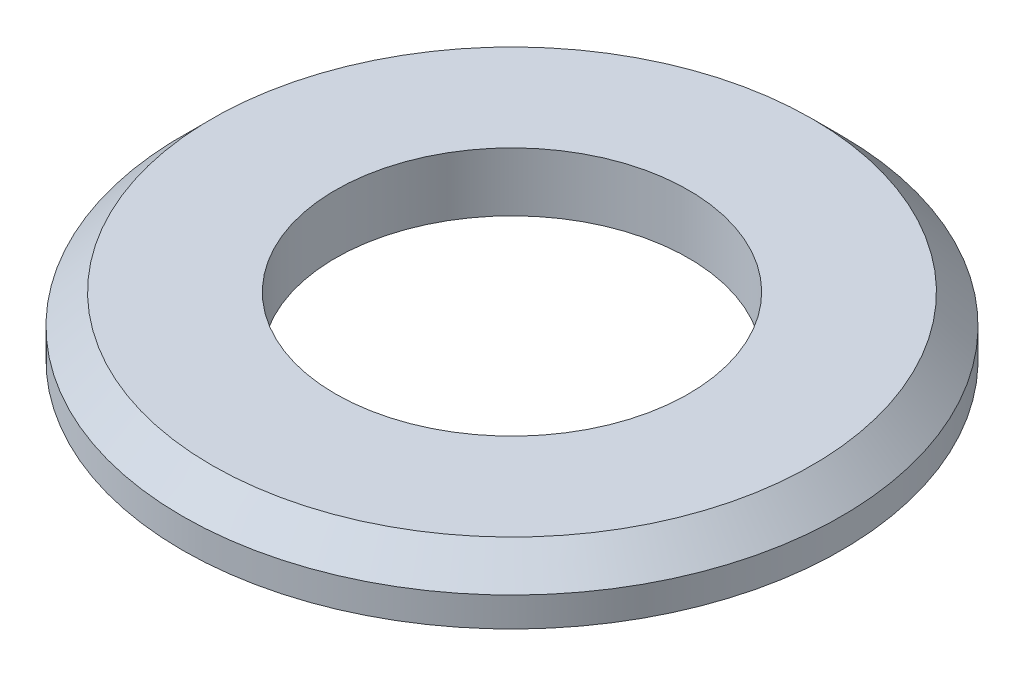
ISO-10303-21;
HEADER;
FILE_DESCRIPTION(('STEP AP214'),'2;1');
FILE_NAME('part.step','',(''),(''),'','','');
FILE_SCHEMA(('AUTOMOTIVE_DESIGN { 1 0 10303 214 1 1 1 1 }'));
ENDSEC;
DATA;
#1=APPLICATION_CONTEXT('core data for automotive mechanical design processes');
#2=APPLICATION_PROTOCOL_DEFINITION('international standard','automotive_design',2000,#1);
#3=PRODUCT_CONTEXT('',#1,'mechanical');
#4=PRODUCT('Part','Part','',(#3));
#5=PRODUCT_RELATED_PRODUCT_CATEGORY('part','',(#4));
#6=PRODUCT_DEFINITION_FORMATION('','',#4);
#7=PRODUCT_DEFINITION_CONTEXT('part definition',#1,'design');
#8=PRODUCT_DEFINITION('design','',#6,#7);
#9=PRODUCT_DEFINITION_SHAPE('','',#8);
#10=(LENGTH_UNIT() NAMED_UNIT(*) SI_UNIT(.MILLI.,.METRE.));
#11=(NAMED_UNIT(*) PLANE_ANGLE_UNIT() SI_UNIT($,.RADIAN.));
#12=(NAMED_UNIT(*) SI_UNIT($,.STERADIAN.) SOLID_ANGLE_UNIT());
#13=UNCERTAINTY_MEASURE_WITH_UNIT(LENGTH_MEASURE(1.E-05),#10,'distance_accuracy_value','');
#14=(GEOMETRIC_REPRESENTATION_CONTEXT(3) GLOBAL_UNCERTAINTY_ASSIGNED_CONTEXT((#13)) GLOBAL_UNIT_ASSIGNED_CONTEXT((#10,
#11,#12)) REPRESENTATION_CONTEXT('',''));
#15=CARTESIAN_POINT('',(0.,0.,0.));
#16=DIRECTION('',(0.,0.,1.));
#17=DIRECTION('',(1.,0.,0.));
#18=AXIS2_PLACEMENT_3D('',#15,#16,#17);
#19=CARTESIAN_POINT('',(0.,2.5,0.));
#20=DIRECTION('',(0.,1.,0.));
#21=DIRECTION('',(0.,0.,1.));
#22=AXIS2_PLACEMENT_3D('',#19,#20,#21);
#23=PLANE('',#22);
#24=CARTESIAN_POINT('',(0.,2.5,0.));
#25=DIRECTION('',(0.,1.,0.));
#26=DIRECTION('',(0.,0.,1.));
#27=AXIS2_PLACEMENT_3D('',#24,#25,#26);
#28=CIRCLE('',#27,12.75);
#29=CARTESIAN_POINT('',(0.,2.5,-12.75));
#30=VERTEX_POINT('',#29);
#31=EDGE_CURVE('E35',#30,#30,#28,.T.);
#32=ORIENTED_EDGE('',*,*,#31,.T.);
#33=EDGE_LOOP('',(#32));
#34=FACE_BOUND('',#33,.T.);
#35=CARTESIAN_POINT('',(0.,2.5,0.));
#36=DIRECTION('',(0.,1.,0.));
#37=DIRECTION('',(0.,0.,1.));
#38=AXIS2_PLACEMENT_3D('',#35,#36,#37);
#39=CIRCLE('',#38,7.5);
#40=CARTESIAN_POINT('',(0.,2.5,7.5));
#41=VERTEX_POINT('',#40);
#42=EDGE_CURVE('E43',#41,#41,#39,.T.);
#43=ORIENTED_EDGE('',*,*,#42,.F.);
#44=EDGE_LOOP('',(#43));
#45=FACE_BOUND('',#44,.T.);
#46=ADVANCED_FACE('F28',(#34,#45),#23,.T.);
#47=CARTESIAN_POINT('',(0.,0.,0.));
#48=DIRECTION('',(0.,1.,0.));
#49=DIRECTION('',(0.,0.,1.));
#50=AXIS2_PLACEMENT_3D('',#47,#48,#49);
#51=PLANE('',#50);
#52=CARTESIAN_POINT('',(0.,0.,0.));
#53=DIRECTION('',(0.,1.,0.));
#54=DIRECTION('',(0.,0.,1.));
#55=AXIS2_PLACEMENT_3D('',#52,#53,#54);
#56=CIRCLE('',#55,14.);
#57=CARTESIAN_POINT('',(0.,0.,14.));
#58=VERTEX_POINT('',#57);
#59=EDGE_CURVE('E39',#58,#58,#56,.T.);
#60=ORIENTED_EDGE('',*,*,#59,.F.);
#61=EDGE_LOOP('',(#60));
#62=FACE_BOUND('',#61,.T.);
#63=CARTESIAN_POINT('',(0.,0.,0.));
#64=DIRECTION('',(0.,1.,0.));
#65=DIRECTION('',(0.,0.,1.));
#66=AXIS2_PLACEMENT_3D('',#63,#64,#65);
#67=CIRCLE('',#66,7.5);
#68=CARTESIAN_POINT('',(0.,0.,7.5));
#69=VERTEX_POINT('',#68);
#70=EDGE_CURVE('E48',#69,#69,#67,.T.);
#71=ORIENTED_EDGE('',*,*,#70,.T.);
#72=EDGE_LOOP('',(#71));
#73=FACE_BOUND('',#72,.T.);
#74=ADVANCED_FACE('F52',(#62,#73),#51,.F.);
#75=CARTESIAN_POINT('',(0.,2.5,0.));
#76=DIRECTION('',(0.,-1.,0.));
#77=DIRECTION('',(0.,0.,-1.));
#78=AXIS2_PLACEMENT_3D('',#75,#76,#77);
#79=CYLINDRICAL_SURFACE('',#78,14.);
#80=CARTESIAN_POINT('',(0.,1.24999999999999,0.));
#81=DIRECTION('',(0.,1.,0.));
#82=DIRECTION('',(0.,0.,1.));
#83=AXIS2_PLACEMENT_3D('',#80,#81,#82);
#84=CIRCLE('',#83,14.);
#85=CARTESIAN_POINT('',(0.,1.24999999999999,-14.));
#86=VERTEX_POINT('',#85);
#87=EDGE_CURVE('E10',#86,#86,#84,.F.);
#88=ORIENTED_EDGE('',*,*,#87,.T.);
#89=EDGE_LOOP('',(#88));
#90=FACE_BOUND('',#89,.T.);
#91=ORIENTED_EDGE('',*,*,#59,.T.);
#92=EDGE_LOOP('',(#91));
#93=FACE_BOUND('',#92,.T.);
#94=ADVANCED_FACE('F30',(#90,#93),#79,.T.);
#95=CARTESIAN_POINT('',(0.,2.5,0.));
#96=DIRECTION('',(0.,-1.,0.));
#97=DIRECTION('',(0.,0.,-1.));
#98=AXIS2_PLACEMENT_3D('',#95,#96,#97);
#99=CYLINDRICAL_SURFACE('',#98,7.5);
#100=ORIENTED_EDGE('',*,*,#42,.T.);
#101=EDGE_LOOP('',(#100));
#102=FACE_BOUND('',#101,.T.);
#103=ORIENTED_EDGE('',*,*,#70,.F.);
#104=EDGE_LOOP('',(#103));
#105=FACE_BOUND('',#104,.T.);
#106=ADVANCED_FACE('F54',(#102,#105),#99,.F.);
#107=CARTESIAN_POINT('',(0.,2.5,0.));
#108=DIRECTION('',(0.,-1.,0.));
#109=DIRECTION('',(0.,0.,-1.));
#110=AXIS2_PLACEMENT_3D('',#107,#108,#109);
#111=CONICAL_SURFACE('',#110,12.75,0.785398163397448);
#112=CARTESIAN_POINT('',(0.,1.24999999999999,-14.));
#113=CARTESIAN_POINT('',(0.,1.26302083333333,-13.9869791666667));
#114=CARTESIAN_POINT('',(0.,1.27604166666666,-13.9739583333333));
#115=CARTESIAN_POINT('',(0.,1.30208333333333,-13.9479166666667));
#116=CARTESIAN_POINT('',(0.,1.31510416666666,-13.9348958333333));
#117=CARTESIAN_POINT('',(0.,1.34114583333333,-13.9088541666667));
#118=CARTESIAN_POINT('',(0.,1.35416666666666,-13.8958333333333));
#119=CARTESIAN_POINT('',(0.,1.38020833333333,-13.8697916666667));
#120=CARTESIAN_POINT('',(0.,1.39322916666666,-13.8567708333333));
#121=CARTESIAN_POINT('',(0.,1.41927083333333,-13.8307291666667));
#122=CARTESIAN_POINT('',(0.,1.43229166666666,-13.8177083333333));
#123=CARTESIAN_POINT('',(0.,1.45833333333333,-13.7916666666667));
#124=CARTESIAN_POINT('',(0.,1.47135416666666,-13.7786458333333));
#125=CARTESIAN_POINT('',(0.,1.49739583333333,-13.7526041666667));
#126=CARTESIAN_POINT('',(0.,1.51041666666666,-13.7395833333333));
#127=CARTESIAN_POINT('',(0.,1.53645833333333,-13.7135416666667));
#128=CARTESIAN_POINT('',(0.,1.54947916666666,-13.7005208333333));
#129=CARTESIAN_POINT('',(0.,1.57552083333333,-13.6744791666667));
#130=CARTESIAN_POINT('',(0.,1.58854166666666,-13.6614583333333));
#131=CARTESIAN_POINT('',(0.,1.61458333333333,-13.6354166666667));
#132=CARTESIAN_POINT('',(0.,1.62760416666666,-13.6223958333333));
#133=CARTESIAN_POINT('',(0.,1.65364583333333,-13.5963541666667));
#134=CARTESIAN_POINT('',(0.,1.66666666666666,-13.5833333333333));
#135=CARTESIAN_POINT('',(0.,1.69270833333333,-13.5572916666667));
#136=CARTESIAN_POINT('',(0.,1.70572916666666,-13.5442708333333));
#137=CARTESIAN_POINT('',(0.,1.73177083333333,-13.5182291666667));
#138=CARTESIAN_POINT('',(0.,1.74479166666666,-13.5052083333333));
#139=CARTESIAN_POINT('',(0.,1.77083333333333,-13.4791666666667));
#140=CARTESIAN_POINT('',(0.,1.78385416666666,-13.4661458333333));
#141=CARTESIAN_POINT('',(0.,1.80989583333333,-13.4401041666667));
#142=CARTESIAN_POINT('',(0.,1.82291666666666,-13.4270833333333));
#143=CARTESIAN_POINT('',(0.,1.84895833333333,-13.4010416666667));
#144=CARTESIAN_POINT('',(0.,1.86197916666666,-13.3880208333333));
#145=CARTESIAN_POINT('',(0.,1.88802083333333,-13.3619791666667));
#146=CARTESIAN_POINT('',(0.,1.90104166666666,-13.3489583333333));
#147=CARTESIAN_POINT('',(0.,1.92708333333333,-13.3229166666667));
#148=CARTESIAN_POINT('',(0.,1.94010416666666,-13.3098958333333));
#149=CARTESIAN_POINT('',(0.,1.96614583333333,-13.2838541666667));
#150=CARTESIAN_POINT('',(0.,1.97916666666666,-13.2708333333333));
#151=CARTESIAN_POINT('',(0.,2.00520833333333,-13.2447916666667));
#152=CARTESIAN_POINT('',(0.,2.01822916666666,-13.2317708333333));
#153=CARTESIAN_POINT('',(0.,2.04427083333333,-13.2057291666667));
#154=CARTESIAN_POINT('',(0.,2.05729166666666,-13.1927083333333));
#155=CARTESIAN_POINT('',(0.,2.08333333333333,-13.1666666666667));
#156=CARTESIAN_POINT('',(0.,2.09635416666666,-13.1536458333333));
#157=CARTESIAN_POINT('',(0.,2.12239583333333,-13.1276041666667));
#158=CARTESIAN_POINT('',(0.,2.13541666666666,-13.1145833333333));
#159=CARTESIAN_POINT('',(0.,2.16145833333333,-13.0885416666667));
#160=CARTESIAN_POINT('',(0.,2.17447916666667,-13.0755208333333));
#161=CARTESIAN_POINT('',(0.,2.20052083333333,-13.0494791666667));
#162=CARTESIAN_POINT('',(0.,2.21354166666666,-13.0364583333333));
#163=CARTESIAN_POINT('',(0.,2.23958333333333,-13.0104166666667));
#164=CARTESIAN_POINT('',(0.,2.25260416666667,-12.9973958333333));
#165=CARTESIAN_POINT('',(0.,2.27864583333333,-12.9713541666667));
#166=CARTESIAN_POINT('',(0.,2.29166666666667,-12.9583333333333));
#167=CARTESIAN_POINT('',(0.,2.31770833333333,-12.9322916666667));
#168=CARTESIAN_POINT('',(0.,2.33072916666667,-12.9192708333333));
#169=CARTESIAN_POINT('',(0.,2.35677083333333,-12.8932291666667));
#170=CARTESIAN_POINT('',(0.,2.36979166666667,-12.8802083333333));
#171=CARTESIAN_POINT('',(0.,2.39583333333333,-12.8541666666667));
#172=CARTESIAN_POINT('',(0.,2.40885416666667,-12.8411458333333));
#173=CARTESIAN_POINT('',(0.,2.43489583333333,-12.8151041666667));
#174=CARTESIAN_POINT('',(0.,2.44791666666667,-12.8020833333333));
#175=CARTESIAN_POINT('',(0.,2.47395833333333,-12.7760416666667));
#176=CARTESIAN_POINT('',(0.,2.48697916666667,-12.7630208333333));
#177=CARTESIAN_POINT('',(0.,2.5,-12.75));
#178=B_SPLINE_CURVE_WITH_KNOTS('',3,(#112,#113,#114,#115,#116,#117,#118,#119,#120,#121,#122,
#123,#124,#125,#126,#127,#128,#129,#130,#131,#132,#133,#134,#135,#136,#137,#138,#139,#140,#141,
#142,#143,#144,#145,#146,#147,#148,#149,#150,#151,#152,#153,#154,#155,#156,#157,#158,#159,#160,
#161,#162,#163,#164,#165,#166,#167,#168,#169,#170,#171,#172,#173,#174,#175,#176,#177),
.UNSPECIFIED.,.F.,.F.,(4,2,2,2,2,2,2,2,2,2,2,2,2,2,2,2,2,2,2,2,2,2,2,2,2,2,2,2,2,2,2,2,4),(0.,
0.0552427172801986,0.110485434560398,0.165728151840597,0.220970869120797,0.276213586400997,
0.331456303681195,0.386699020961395,0.441941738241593,0.497184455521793,0.552427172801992,
0.607669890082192,0.662912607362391,0.71815532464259,0.77339804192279,0.828640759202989,
0.883883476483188,0.939126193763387,0.994368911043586,1.04961162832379,1.10485434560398,
1.16009706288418,1.21533978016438,1.27058249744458,1.32582521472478,1.38106793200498,
1.43631064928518,1.49155336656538,1.54679608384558,1.60203880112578,1.65728151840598,
1.71252423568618,1.76776695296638),.UNSPECIFIED.);
#179=EDGE_CURVE('BSEAM56',#86,#30,#178,.T.);
#180=ORIENTED_EDGE('',*,*,#87,.F.);
#181=ORIENTED_EDGE('',*,*,#31,.F.);
#182=ORIENTED_EDGE('',*,*,#179,.T.);
#183=ORIENTED_EDGE('',*,*,#179,.F.);
#184=EDGE_LOOP('',(#180,#182,#181,#183));
#185=FACE_BOUND('',#184,.T.);
#186=ADVANCED_FACE('F56',(#185),#111,.T.);
#187=CLOSED_SHELL('',(#46,#74,#94,#106,#186));
#188=MANIFOLD_SOLID_BREP('B2',#187);
#189=ADVANCED_BREP_SHAPE_REPRESENTATION('',(#18,#188),#14);
#190=SHAPE_DEFINITION_REPRESENTATION(#9,#189);
ENDSEC;
END-ISO-10303-21;
